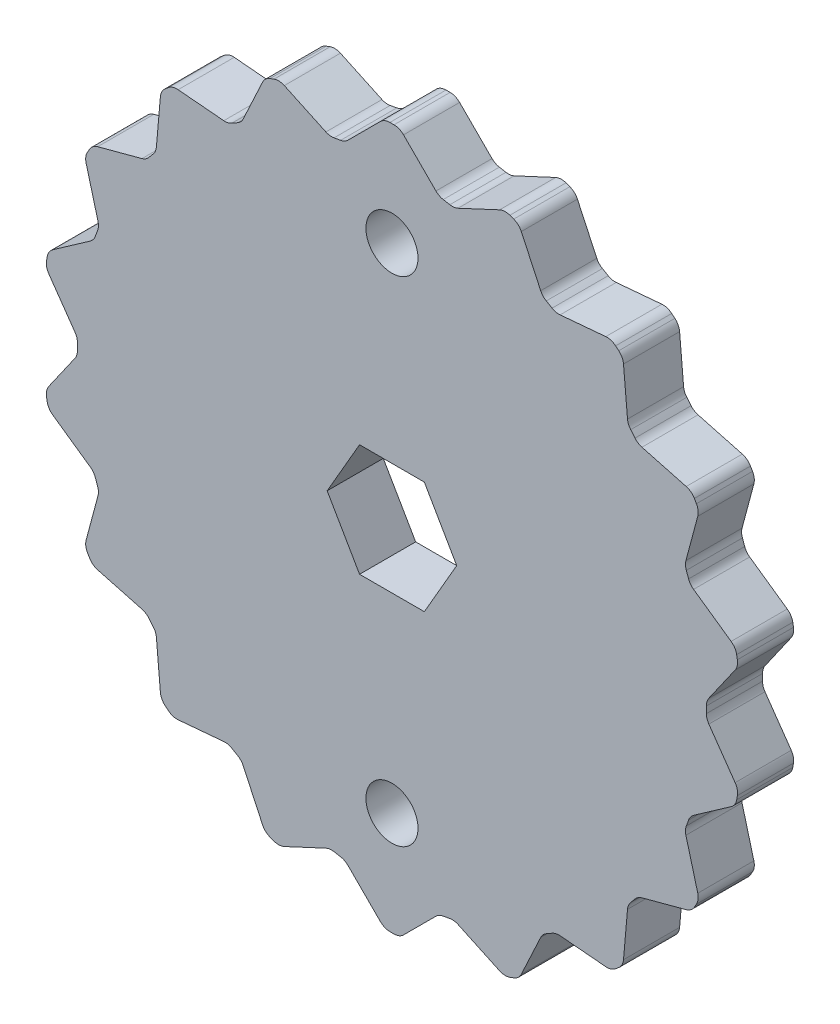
from build123d import *

# Parameters (mm, degrees)
BOSS_EXTRUDE1_DEPTH      = 3.175
SKETCH3_R                = 17.797328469
BOSS_EXTRUDE2_DEPTH      = 3.175
FILLET1_R                = 0.762
CIRPATTERN1_COUNT        = 18
FILLET1_OF_CIRPATTERN1_R = 0.762
CUT_EXTRUDE1_DEPTH       = 29.033367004
F_4_CLEARANCE_HOLE1_D    = 2.9464


with BuildPart() as part:
    # Sketch2 → Boss-Extrude1 (new body)
    with BuildSketch(Plane.XY):
        with BuildLine():
            Line((0.4318, 19.829328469), (-0.4318, 19.829328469))
            Line((-0.4318, 19.829328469), (-2.664365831, 17.596762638))
            ThreePointArc((-2.664365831, 17.596762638), (-2.87763148, 17.563147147), (-3.090473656, 17.526947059))
            ThreePointArc((-3.090473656, 17.526947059), (0, 14.695049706), (3.090473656, 17.526947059))
            ThreePointArc((3.090473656, 17.526947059), (2.87763148, 17.563147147), (2.664365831, 17.596762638))
            Line((2.664365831, 17.596762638), (0.4318, 19.829328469))
        make_face()
    boss_extrude1 = extrude(amount=BOSS_EXTRUDE1_DEPTH)

    # Sketch3 → Boss-Extrude2 (add)
    with BuildSketch(Plane.XY):
        Circle(SKETCH3_R)
    extrude(amount=BOSS_EXTRUDE2_DEPTH)

    # Fillet1
    fillet1_edges = [part.edges().sort_by_distance(p)[0] for p in [
        (-2.664365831, 17.596762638, 1.5875),
        (-0.4318, 19.829328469, 1.5875),
        (0.4318, 19.829328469, 1.5875),
        (2.664365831, 17.596762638, 1.5875),
    ]]
    fillet(fillet1_edges, radius=FILLET1_R)

    # CirPattern1: Boss-Extrude1 ×18 about axis
    cirpattern1_axis = Axis((0, 0, 0), (0, 0, 1))
    for i in range(1, CIRPATTERN1_COUNT):
        add(boss_extrude1.rotate(cirpattern1_axis, i * 360 / CIRPATTERN1_COUNT))

    # Fillet1 of CirPattern1
    fillet1_of_cirpattern1_edges = [part.edges().sort_by_distance(p)[0] for p in [
        (-8.52213219, 15.624281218, 1.5875),
        (-7.187789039, 18.485789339, 1.5875),
        (-6.376270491, 18.781157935, 1.5875),
        (-3.51476237, 17.446814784, 1.5875),
        (-13.352003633, 11.767280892, 1.5875),
        (-13.076824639, 14.912591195, 1.5875),
        (-12.415268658, 15.467702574, 1.5875),
        (-9.269958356, 15.19252358, 1.5875),
        (-16.571426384, 6.490972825, 1.5875),
        (-17.388602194, 9.540714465, 1.5875),
        (-16.956802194, 10.288614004, 1.5875),
        (-13.907060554, 11.105789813, 1.5875),
        (-17.792090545, 0.431757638, 1.5875),
        (-19.603057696, 3.018086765, 1.5875),
        (-19.45309513, 3.868566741, 1.5875),
        (-16.866766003, 5.679533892, 1.5875),
        (-16.866766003, -5.679533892, 1.5875),
        (-19.45309513, -3.868566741, 1.5875),
        (-19.603057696, -3.018086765, 1.5875),
        (-17.792090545, -0.431757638, 1.5875),
        (-13.907060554, -11.105789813, 1.5875),
        (-16.956802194, -10.288614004, 1.5875),
        (-17.388602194, -9.540714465, 1.5875),
        (-16.571426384, -6.490972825, 1.5875),
        (-9.269958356, -15.19252358, 1.5875),
        (-12.415268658, -15.467702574, 1.5875),
        (-13.076824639, -14.912591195, 1.5875),
        (-13.352003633, -11.767280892, 1.5875),
        (-3.51476237, -17.446814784, 1.5875),
        (-6.376270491, -18.781157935, 1.5875),
        (-7.187789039, -18.485789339, 1.5875),
        (-8.52213219, -15.624281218, 1.5875),
        (2.664365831, -17.596762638, 1.5875),
        (0.4318, -19.829328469, 1.5875),
        (-0.4318, -19.829328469, 1.5875),
        (-2.664365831, -17.596762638, 1.5875),
        (8.52213219, -15.624281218, 1.5875),
        (7.187789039, -18.485789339, 1.5875),
        (6.376270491, -18.781157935, 1.5875),
        (3.51476237, -17.446814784, 1.5875),
        (13.352003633, -11.767280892, 1.5875),
        (13.076824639, -14.912591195, 1.5875),
        (12.415268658, -15.467702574, 1.5875),
        (9.269958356, -15.19252358, 1.5875),
        (16.571426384, -6.490972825, 1.5875),
        (17.388602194, -9.540714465, 1.5875),
        (16.956802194, -10.288614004, 1.5875),
        (13.907060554, -11.105789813, 1.5875),
        (17.792090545, -0.431757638, 1.5875),
        (19.603057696, -3.018086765, 1.5875),
        (19.45309513, -3.868566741, 1.5875),
        (16.866766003, -5.679533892, 1.5875),
        (16.866766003, 5.679533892, 1.5875),
        (19.45309513, 3.868566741, 1.5875),
        (19.603057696, 3.018086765, 1.5875),
        (17.792090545, 0.431757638, 1.5875),
        (13.907060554, 11.105789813, 1.5875),
        (16.956802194, 10.288614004, 1.5875),
        (17.388602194, 9.540714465, 1.5875),
        (16.571426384, 6.490972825, 1.5875),
        (9.269958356, 15.19252358, 1.5875),
        (12.415268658, 15.467702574, 1.5875),
        (13.076824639, 14.912591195, 1.5875),
        (13.352003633, 11.767280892, 1.5875),
        (3.51476237, 17.446814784, 1.5875),
        (6.376270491, 18.781157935, 1.5875),
        (7.187789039, 18.485789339, 1.5875),
        (8.52213219, 15.624281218, 1.5875),
    ]]
    fillet(fillet1_of_cirpattern1_edges, radius=FILLET1_OF_CIRPATTERN1_R)

    # Sketch4 → Cut-Extrude1 (cut, through all)
    with BuildSketch(Plane.XY.offset(3.175)):
        Polygon((1.833087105, -3.175), (3.666174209, 0), (1.833087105, 3.175), (-1.833087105, 3.175), (-3.666174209, 0), (-1.833087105, -3.175), align=None)
    extrude(amount=-CUT_EXTRUDE1_DEPTH, mode=Mode.SUBTRACT)

    # 4 Clearance Hole1 (through all)
    with Locations(Plane.XY.offset(3.175)):
        with Locations((0, 13.97), (0, -13.97)):
            Hole(F_4_CLEARANCE_HOLE1_D / 2)


solid = part.part
